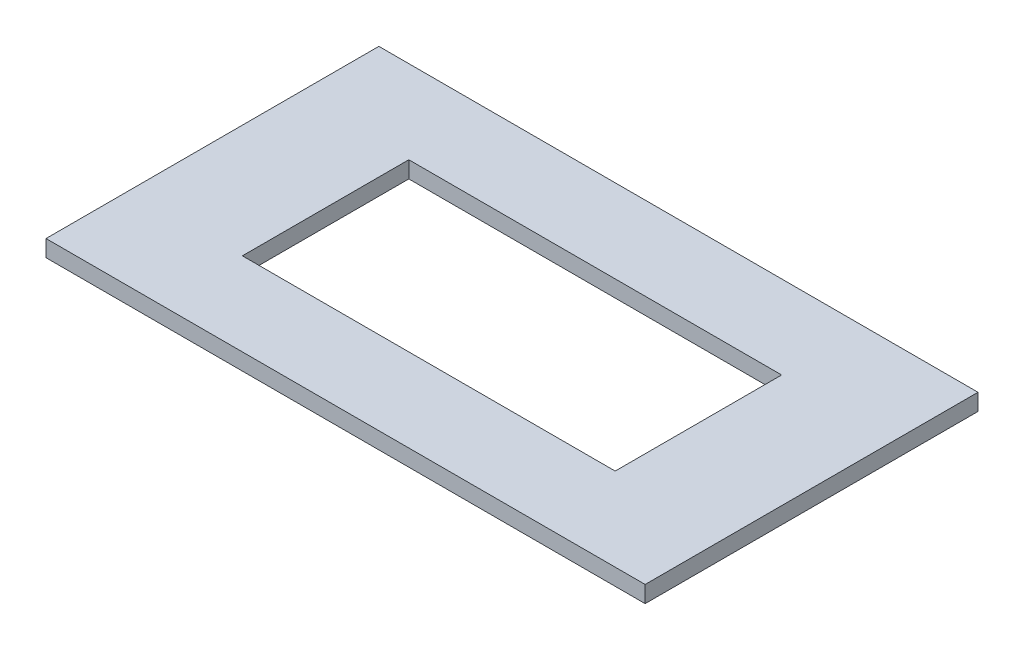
ISO-10303-21;
HEADER;
FILE_DESCRIPTION(('STEP AP214'),'2;1');
FILE_NAME('part.step','',(''),(''),'','','');
FILE_SCHEMA(('AUTOMOTIVE_DESIGN { 1 0 10303 214 1 1 1 1 }'));
ENDSEC;
DATA;
#1=APPLICATION_CONTEXT('core data for automotive mechanical design processes');
#2=APPLICATION_PROTOCOL_DEFINITION('international standard','automotive_design',2000,#1);
#3=PRODUCT_CONTEXT('',#1,'mechanical');
#4=PRODUCT('Part','Part','',(#3));
#5=PRODUCT_RELATED_PRODUCT_CATEGORY('part','',(#4));
#6=PRODUCT_DEFINITION_FORMATION('','',#4);
#7=PRODUCT_DEFINITION_CONTEXT('part definition',#1,'design');
#8=PRODUCT_DEFINITION('design','',#6,#7);
#9=PRODUCT_DEFINITION_SHAPE('','',#8);
#10=(LENGTH_UNIT() NAMED_UNIT(*) SI_UNIT(.MILLI.,.METRE.));
#11=(NAMED_UNIT(*) PLANE_ANGLE_UNIT() SI_UNIT($,.RADIAN.));
#12=(NAMED_UNIT(*) SI_UNIT($,.STERADIAN.) SOLID_ANGLE_UNIT());
#13=UNCERTAINTY_MEASURE_WITH_UNIT(LENGTH_MEASURE(1.E-05),#10,'distance_accuracy_value','');
#14=(GEOMETRIC_REPRESENTATION_CONTEXT(3) GLOBAL_UNCERTAINTY_ASSIGNED_CONTEXT((#13)) GLOBAL_UNIT_ASSIGNED_CONTEXT((#10,
#11,#12)) REPRESENTATION_CONTEXT('',''));
#15=CARTESIAN_POINT('',(0.,0.,0.));
#16=DIRECTION('',(0.,0.,1.));
#17=DIRECTION('',(1.,0.,0.));
#18=AXIS2_PLACEMENT_3D('',#15,#16,#17);
#19=CARTESIAN_POINT('',(0.,2.5,0.));
#20=DIRECTION('',(0.,1.,0.));
#21=DIRECTION('',(0.,0.,1.));
#22=AXIS2_PLACEMENT_3D('',#19,#20,#21);
#23=PLANE('',#22);
#24=DIRECTION('',(0.,0.,-1.));
#25=VECTOR('',#24,1.);
#26=CARTESIAN_POINT('',(45.,2.5,-25.));
#27=LINE('',#26,#25);
#28=CARTESIAN_POINT('',(45.,2.5,25.));
#29=VERTEX_POINT('',#28);
#30=CARTESIAN_POINT('',(45.,2.5,-25.));
#31=VERTEX_POINT('',#30);
#32=EDGE_CURVE('E135',#29,#31,#27,.T.);
#33=ORIENTED_EDGE('',*,*,#32,.T.);
#34=DIRECTION('',(-1.,0.,0.));
#35=VECTOR('',#34,1.);
#36=CARTESIAN_POINT('',(-45.,2.5,-25.));
#37=LINE('',#36,#35);
#38=CARTESIAN_POINT('',(-45.,2.5,-25.));
#39=VERTEX_POINT('',#38);
#40=EDGE_CURVE('E138',#31,#39,#37,.T.);
#41=ORIENTED_EDGE('',*,*,#40,.T.);
#42=DIRECTION('',(0.,0.,1.));
#43=VECTOR('',#42,1.);
#44=CARTESIAN_POINT('',(-45.,2.5,-25.));
#45=LINE('',#44,#43);
#46=CARTESIAN_POINT('',(-45.,2.5,25.));
#47=VERTEX_POINT('',#46);
#48=EDGE_CURVE('E141',#39,#47,#45,.T.);
#49=ORIENTED_EDGE('',*,*,#48,.T.);
#50=DIRECTION('',(1.,0.,0.));
#51=VECTOR('',#50,1.);
#52=CARTESIAN_POINT('',(-45.,2.5,25.));
#53=LINE('',#52,#51);
#54=EDGE_CURVE('E143',#47,#29,#53,.T.);
#55=ORIENTED_EDGE('',*,*,#54,.T.);
#56=EDGE_LOOP('',(#33,#41,#49,#55));
#57=FACE_BOUND('',#56,.T.);
#58=DIRECTION('',(1.,0.,0.));
#59=VECTOR('',#58,1.);
#60=CARTESIAN_POINT('',(28.,2.5,12.5));
#61=LINE('',#60,#59);
#62=CARTESIAN_POINT('',(-28.,2.5,12.5));
#63=VERTEX_POINT('',#62);
#64=CARTESIAN_POINT('',(28.,2.5,12.5));
#65=VERTEX_POINT('',#64);
#66=EDGE_CURVE('E107',#63,#65,#61,.T.);
#67=ORIENTED_EDGE('',*,*,#66,.F.);
#68=DIRECTION('',(0.,0.,1.));
#69=VECTOR('',#68,1.);
#70=CARTESIAN_POINT('',(-28.,2.5,12.5));
#71=LINE('',#70,#69);
#72=CARTESIAN_POINT('',(-28.,2.5,-12.5));
#73=VERTEX_POINT('',#72);
#74=EDGE_CURVE('E99',#73,#63,#71,.T.);
#75=ORIENTED_EDGE('',*,*,#74,.F.);
#76=DIRECTION('',(-1.,0.,0.));
#77=VECTOR('',#76,1.);
#78=CARTESIAN_POINT('',(28.,2.5,-12.5));
#79=LINE('',#78,#77);
#80=CARTESIAN_POINT('',(28.,2.5,-12.5));
#81=VERTEX_POINT('',#80);
#82=EDGE_CURVE('E121',#81,#73,#79,.T.);
#83=ORIENTED_EDGE('',*,*,#82,.F.);
#84=DIRECTION('',(0.,0.,-1.));
#85=VECTOR('',#84,1.);
#86=CARTESIAN_POINT('',(28.,2.5,12.5));
#87=LINE('',#86,#85);
#88=EDGE_CURVE('E119',#65,#81,#87,.T.);
#89=ORIENTED_EDGE('',*,*,#88,.F.);
#90=EDGE_LOOP('',(#67,#75,#83,#89));
#91=FACE_BOUND('',#90,.T.);
#92=ADVANCED_FACE('F34',(#57,#91),#23,.T.);
#93=CARTESIAN_POINT('',(0.,0.,0.));
#94=DIRECTION('',(0.,1.,0.));
#95=DIRECTION('',(0.,0.,1.));
#96=AXIS2_PLACEMENT_3D('',#93,#94,#95);
#97=PLANE('',#96);
#98=DIRECTION('',(0.,0.,-1.));
#99=VECTOR('',#98,1.);
#100=CARTESIAN_POINT('',(45.,0.,-25.));
#101=LINE('',#100,#99);
#102=CARTESIAN_POINT('',(45.,0.,25.));
#103=VERTEX_POINT('',#102);
#104=CARTESIAN_POINT('',(45.,0.,-25.));
#105=VERTEX_POINT('',#104);
#106=EDGE_CURVE('E115',#103,#105,#101,.T.);
#107=ORIENTED_EDGE('',*,*,#106,.F.);
#108=DIRECTION('',(1.,0.,0.));
#109=VECTOR('',#108,1.);
#110=CARTESIAN_POINT('',(-45.,0.,25.));
#111=LINE('',#110,#109);
#112=CARTESIAN_POINT('',(-45.,0.,25.));
#113=VERTEX_POINT('',#112);
#114=EDGE_CURVE('E139',#113,#103,#111,.T.);
#115=ORIENTED_EDGE('',*,*,#114,.F.);
#116=DIRECTION('',(0.,0.,1.));
#117=VECTOR('',#116,1.);
#118=CARTESIAN_POINT('',(-45.,0.,-25.));
#119=LINE('',#118,#117);
#120=CARTESIAN_POINT('',(-45.,0.,-25.));
#121=VERTEX_POINT('',#120);
#122=EDGE_CURVE('E150',#121,#113,#119,.T.);
#123=ORIENTED_EDGE('',*,*,#122,.F.);
#124=DIRECTION('',(-1.,0.,0.));
#125=VECTOR('',#124,1.);
#126=CARTESIAN_POINT('',(-45.,0.,-25.));
#127=LINE('',#126,#125);
#128=EDGE_CURVE('E148',#105,#121,#127,.T.);
#129=ORIENTED_EDGE('',*,*,#128,.F.);
#130=EDGE_LOOP('',(#107,#115,#123,#129));
#131=FACE_BOUND('',#130,.T.);
#132=DIRECTION('',(0.,0.,1.));
#133=VECTOR('',#132,1.);
#134=CARTESIAN_POINT('',(-28.,0.,12.5));
#135=LINE('',#134,#133);
#136=CARTESIAN_POINT('',(-28.,0.,-12.5));
#137=VERTEX_POINT('',#136);
#138=CARTESIAN_POINT('',(-28.,0.,12.5));
#139=VERTEX_POINT('',#138);
#140=EDGE_CURVE('E57',#137,#139,#135,.T.);
#141=ORIENTED_EDGE('',*,*,#140,.T.);
#142=DIRECTION('',(1.,0.,0.));
#143=VECTOR('',#142,1.);
#144=CARTESIAN_POINT('',(28.,0.,12.5));
#145=LINE('',#144,#143);
#146=CARTESIAN_POINT('',(28.,0.,12.5));
#147=VERTEX_POINT('',#146);
#148=EDGE_CURVE('E114',#139,#147,#145,.T.);
#149=ORIENTED_EDGE('',*,*,#148,.T.);
#150=DIRECTION('',(0.,0.,-1.));
#151=VECTOR('',#150,1.);
#152=CARTESIAN_POINT('',(28.,0.,12.5));
#153=LINE('',#152,#151);
#154=CARTESIAN_POINT('',(28.,0.,-12.5));
#155=VERTEX_POINT('',#154);
#156=EDGE_CURVE('E127',#147,#155,#153,.T.);
#157=ORIENTED_EDGE('',*,*,#156,.T.);
#158=DIRECTION('',(-1.,0.,0.));
#159=VECTOR('',#158,1.);
#160=CARTESIAN_POINT('',(28.,0.,-12.5));
#161=LINE('',#160,#159);
#162=EDGE_CURVE('E108',#155,#137,#161,.T.);
#163=ORIENTED_EDGE('',*,*,#162,.T.);
#164=EDGE_LOOP('',(#141,#149,#157,#163));
#165=FACE_BOUND('',#164,.T.);
#166=ADVANCED_FACE('F168',(#131,#165),#97,.F.);
#167=CARTESIAN_POINT('',(45.,2.5,-25.));
#168=DIRECTION('',(-1.,0.,0.));
#169=DIRECTION('',(0.,0.,1.));
#170=AXIS2_PLACEMENT_3D('',#167,#168,#169);
#171=PLANE('',#170);
#172=ORIENTED_EDGE('',*,*,#106,.T.);
#173=DIRECTION('',(0.,-1.,0.));
#174=VECTOR('',#173,1.);
#175=CARTESIAN_POINT('',(45.,2.5,-25.));
#176=LINE('',#175,#174);
#177=EDGE_CURVE('E11',#31,#105,#176,.T.);
#178=ORIENTED_EDGE('',*,*,#177,.F.);
#179=ORIENTED_EDGE('',*,*,#32,.F.);
#180=DIRECTION('',(0.,-1.,0.));
#181=VECTOR('',#180,1.);
#182=CARTESIAN_POINT('',(45.,2.5,25.));
#183=LINE('',#182,#181);
#184=EDGE_CURVE('E145',#29,#103,#183,.T.);
#185=ORIENTED_EDGE('',*,*,#184,.T.);
#186=EDGE_LOOP('',(#172,#178,#179,#185));
#187=FACE_BOUND('',#186,.T.);
#188=ADVANCED_FACE('F36',(#187),#171,.F.);
#189=CARTESIAN_POINT('',(-45.,2.5,-25.));
#190=DIRECTION('',(0.,0.,1.));
#191=DIRECTION('',(1.,0.,0.));
#192=AXIS2_PLACEMENT_3D('',#189,#190,#191);
#193=PLANE('',#192);
#194=ORIENTED_EDGE('',*,*,#128,.T.);
#195=DIRECTION('',(0.,-1.,0.));
#196=VECTOR('',#195,1.);
#197=CARTESIAN_POINT('',(-45.,2.5,-25.));
#198=LINE('',#197,#196);
#199=EDGE_CURVE('E42',#39,#121,#198,.T.);
#200=ORIENTED_EDGE('',*,*,#199,.F.);
#201=ORIENTED_EDGE('',*,*,#40,.F.);
#202=ORIENTED_EDGE('',*,*,#177,.T.);
#203=EDGE_LOOP('',(#194,#200,#201,#202));
#204=FACE_BOUND('',#203,.T.);
#205=ADVANCED_FACE('F178',(#204),#193,.F.);
#206=CARTESIAN_POINT('',(-45.,2.5,-25.));
#207=DIRECTION('',(1.,0.,0.));
#208=DIRECTION('',(0.,0.,-1.));
#209=AXIS2_PLACEMENT_3D('',#206,#207,#208);
#210=PLANE('',#209);
#211=ORIENTED_EDGE('',*,*,#122,.T.);
#212=DIRECTION('',(0.,-1.,0.));
#213=VECTOR('',#212,1.);
#214=CARTESIAN_POINT('',(-45.,2.5,25.));
#215=LINE('',#214,#213);
#216=EDGE_CURVE('E155',#47,#113,#215,.T.);
#217=ORIENTED_EDGE('',*,*,#216,.F.);
#218=ORIENTED_EDGE('',*,*,#48,.F.);
#219=ORIENTED_EDGE('',*,*,#199,.T.);
#220=EDGE_LOOP('',(#211,#217,#218,#219));
#221=FACE_BOUND('',#220,.T.);
#222=ADVANCED_FACE('F162',(#221),#210,.F.);
#223=CARTESIAN_POINT('',(-45.,2.5,25.));
#224=DIRECTION('',(0.,0.,-1.));
#225=DIRECTION('',(-1.,0.,0.));
#226=AXIS2_PLACEMENT_3D('',#223,#224,#225);
#227=PLANE('',#226);
#228=ORIENTED_EDGE('',*,*,#114,.T.);
#229=ORIENTED_EDGE('',*,*,#184,.F.);
#230=ORIENTED_EDGE('',*,*,#54,.F.);
#231=ORIENTED_EDGE('',*,*,#216,.T.);
#232=EDGE_LOOP('',(#228,#229,#230,#231));
#233=FACE_BOUND('',#232,.T.);
#234=ADVANCED_FACE('F172',(#233),#227,.F.);
#235=CARTESIAN_POINT('',(-28.,2.5,12.5));
#236=DIRECTION('',(1.,0.,0.));
#237=DIRECTION('',(0.,0.,-1.));
#238=AXIS2_PLACEMENT_3D('',#235,#236,#237);
#239=PLANE('',#238);
#240=ORIENTED_EDGE('',*,*,#140,.F.);
#241=DIRECTION('',(0.,-1.,0.));
#242=VECTOR('',#241,1.);
#243=CARTESIAN_POINT('',(-28.,2.5,-12.5));
#244=LINE('',#243,#242);
#245=EDGE_CURVE('E103',#73,#137,#244,.T.);
#246=ORIENTED_EDGE('',*,*,#245,.F.);
#247=ORIENTED_EDGE('',*,*,#74,.T.);
#248=DIRECTION('',(0.,-1.,0.));
#249=VECTOR('',#248,1.);
#250=CARTESIAN_POINT('',(-28.,2.5,12.5));
#251=LINE('',#250,#249);
#252=EDGE_CURVE('E102',#63,#139,#251,.T.);
#253=ORIENTED_EDGE('',*,*,#252,.T.);
#254=EDGE_LOOP('',(#240,#246,#247,#253));
#255=FACE_BOUND('',#254,.T.);
#256=ADVANCED_FACE('F101',(#255),#239,.T.);
#257=CARTESIAN_POINT('',(28.,2.5,12.5));
#258=DIRECTION('',(0.,0.,-1.));
#259=DIRECTION('',(-1.,0.,0.));
#260=AXIS2_PLACEMENT_3D('',#257,#258,#259);
#261=PLANE('',#260);
#262=ORIENTED_EDGE('',*,*,#148,.F.);
#263=ORIENTED_EDGE('',*,*,#252,.F.);
#264=ORIENTED_EDGE('',*,*,#66,.T.);
#265=DIRECTION('',(0.,-1.,0.));
#266=VECTOR('',#265,1.);
#267=CARTESIAN_POINT('',(28.,2.5,12.5));
#268=LINE('',#267,#266);
#269=EDGE_CURVE('E116',#65,#147,#268,.T.);
#270=ORIENTED_EDGE('',*,*,#269,.T.);
#271=EDGE_LOOP('',(#262,#263,#264,#270));
#272=FACE_BOUND('',#271,.T.);
#273=ADVANCED_FACE('F111',(#272),#261,.T.);
#274=CARTESIAN_POINT('',(28.,2.5,12.5));
#275=DIRECTION('',(-1.,0.,0.));
#276=DIRECTION('',(0.,0.,1.));
#277=AXIS2_PLACEMENT_3D('',#274,#275,#276);
#278=PLANE('',#277);
#279=ORIENTED_EDGE('',*,*,#156,.F.);
#280=ORIENTED_EDGE('',*,*,#269,.F.);
#281=ORIENTED_EDGE('',*,*,#88,.T.);
#282=DIRECTION('',(0.,-1.,0.));
#283=VECTOR('',#282,1.);
#284=CARTESIAN_POINT('',(28.,2.5,-12.5));
#285=LINE('',#284,#283);
#286=EDGE_CURVE('E49',#81,#155,#285,.T.);
#287=ORIENTED_EDGE('',*,*,#286,.T.);
#288=EDGE_LOOP('',(#279,#280,#281,#287));
#289=FACE_BOUND('',#288,.T.);
#290=ADVANCED_FACE('F201',(#289),#278,.T.);
#291=CARTESIAN_POINT('',(28.,2.5,-12.5));
#292=DIRECTION('',(0.,0.,1.));
#293=DIRECTION('',(1.,0.,0.));
#294=AXIS2_PLACEMENT_3D('',#291,#292,#293);
#295=PLANE('',#294);
#296=ORIENTED_EDGE('',*,*,#162,.F.);
#297=ORIENTED_EDGE('',*,*,#286,.F.);
#298=ORIENTED_EDGE('',*,*,#82,.T.);
#299=ORIENTED_EDGE('',*,*,#245,.T.);
#300=EDGE_LOOP('',(#296,#297,#298,#299));
#301=FACE_BOUND('',#300,.T.);
#302=ADVANCED_FACE('F205',(#301),#295,.T.);
#303=CLOSED_SHELL('',(#92,#166,#188,#205,#222,#234,#256,#273,#290,#302));
#304=MANIFOLD_SOLID_BREP('B2',#303);
#305=ADVANCED_BREP_SHAPE_REPRESENTATION('',(#18,#304),#14);
#306=SHAPE_DEFINITION_REPRESENTATION(#9,#305);
ENDSEC;
END-ISO-10303-21;
